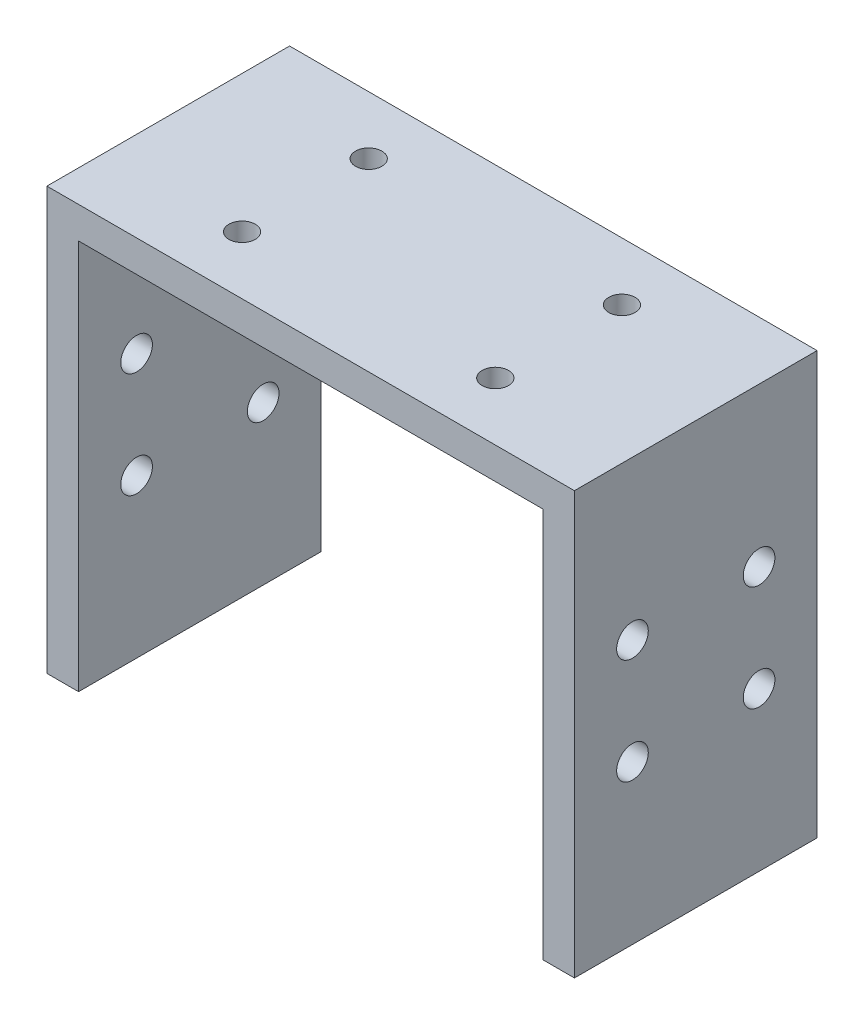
from build123d import *

# Parameters (mm, degrees)
SKETCH1_W           = 50
SKETCH1_H           = 23
BOSS_EXTRUDE1_DEPTH = 40
SHELL1_T            = -3
CUT_EXTRUDE1_REACH  = 50.552
SKETCH2_R           = 1.25
SKETCH3_R           = 1.5
CUT_EXTRUDE2_DEPTH  = 66.055745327


with BuildPart() as part:
    # Sketch1 → Boss-Extrude1 (new body)
    with BuildSketch(Plane(origin=(0, 0, 0), x_dir=(1, 0, 0), z_dir=(0, 1, 0))):
        Rectangle(SKETCH1_W, SKETCH1_H)
    extrude(amount=-BOSS_EXTRUDE1_DEPTH)

    # Shell1
    shell1_openings = [part.faces().sort_by_distance(p)[0] for p in [
        (0, -40, 0),
        (0, -20, 11.5),
        (0, -20, -11.5),
    ]]
    offset(amount=SHELL1_T, openings=shell1_openings, kind=Kind.INTERSECTION)

    # Sketch2 → Cut-Extrude1 (cut, up to next)
    with BuildSketch(Plane(origin=(0, 0, 0), x_dir=(1, 0, 0), z_dir=(0, 1, 0)), mode=Mode.PRIVATE) as cut_extrude1_sk1:
        with Locations(Location((12, 6, 0), (0, 0, 270))):
            Circle(SKETCH2_R)
    cut_extrude1_tool1 = extrude(cut_extrude1_sk1.sketch, amount=-CUT_EXTRUDE1_REACH, mode=Mode.PRIVATE) & part.part
    # Sketch2 → Cut-Extrude1 (cut, up to next)
    with BuildSketch(Plane(origin=(0, 0, 0), x_dir=(1, 0, 0), z_dir=(0, 1, 0)), mode=Mode.PRIVATE) as cut_extrude1_sk2:
        with Locations(Location((12, -6, 0), (0, 0, 270))):
            Circle(SKETCH2_R)
    cut_extrude1_tool2 = extrude(cut_extrude1_sk2.sketch, amount=-CUT_EXTRUDE1_REACH, mode=Mode.PRIVATE) & part.part
    # Sketch2 → Cut-Extrude1 (cut, up to next)
    with BuildSketch(Plane(origin=(0, 0, 0), x_dir=(1, 0, 0), z_dir=(0, 1, 0)), mode=Mode.PRIVATE) as cut_extrude1_sk3:
        with Locations(Location((-12, 6, 0), (0, 0, 270))):
            Circle(SKETCH2_R)
    cut_extrude1_tool3 = extrude(cut_extrude1_sk3.sketch, amount=-CUT_EXTRUDE1_REACH, mode=Mode.PRIVATE) & part.part
    # Sketch2 → Cut-Extrude1 (cut, up to next)
    with BuildSketch(Plane(origin=(0, 0, 0), x_dir=(1, 0, 0), z_dir=(0, 1, 0)), mode=Mode.PRIVATE) as cut_extrude1_sk4:
        with Locations(Location((-12, -6, 0), (0, 0, 270))):
            Circle(SKETCH2_R)
    cut_extrude1_tool4 = extrude(cut_extrude1_sk4.sketch, amount=-CUT_EXTRUDE1_REACH, mode=Mode.PRIVATE) & part.part
    add(cut_extrude1_tool1.solids().sort_by_distance((12, 0, -6))[0], mode=Mode.SUBTRACT)
    add(cut_extrude1_tool2.solids().sort_by_distance((12, 0, 6))[0], mode=Mode.SUBTRACT)
    add(cut_extrude1_tool3.solids().sort_by_distance((-12, 0, -6))[0], mode=Mode.SUBTRACT)
    add(cut_extrude1_tool4.solids().sort_by_distance((-12, 0, 6))[0], mode=Mode.SUBTRACT)

    # Sketch3 → Cut-Extrude2 (cut, through all)
    with BuildSketch(Plane(origin=(25, 0, 0), x_dir=(0, 0, -1), z_dir=(1, 0, 0))):
        with Locations((-6, -15)):
            Circle(SKETCH3_R)
        with Locations((6, -15)):
            Circle(SKETCH3_R)
        with Locations((-6, -25)):
            Circle(SKETCH3_R)
        with Locations((6, -25)):
            Circle(SKETCH3_R)
    extrude(amount=-CUT_EXTRUDE2_DEPTH, mode=Mode.SUBTRACT)


solid = part.part
